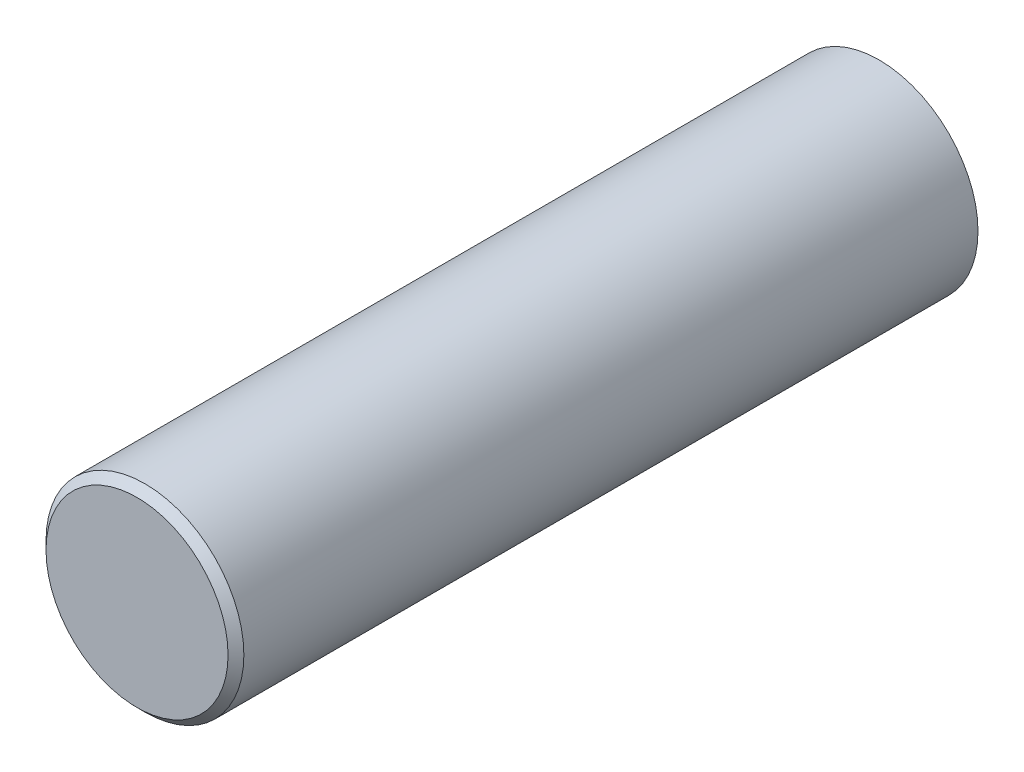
ISO-10303-21;
HEADER;
FILE_DESCRIPTION(('STEP AP214'),'2;1');
FILE_NAME('part.step','',(''),(''),'','','');
FILE_SCHEMA(('AUTOMOTIVE_DESIGN { 1 0 10303 214 1 1 1 1 }'));
ENDSEC;
DATA;
#1=APPLICATION_CONTEXT('core data for automotive mechanical design processes');
#2=APPLICATION_PROTOCOL_DEFINITION('international standard','automotive_design',2000,#1);
#3=PRODUCT_CONTEXT('',#1,'mechanical');
#4=PRODUCT('Part','Part','',(#3));
#5=PRODUCT_RELATED_PRODUCT_CATEGORY('part','',(#4));
#6=PRODUCT_DEFINITION_FORMATION('','',#4);
#7=PRODUCT_DEFINITION_CONTEXT('part definition',#1,'design');
#8=PRODUCT_DEFINITION('design','',#6,#7);
#9=PRODUCT_DEFINITION_SHAPE('','',#8);
#10=(LENGTH_UNIT() NAMED_UNIT(*) SI_UNIT(.MILLI.,.METRE.));
#11=(NAMED_UNIT(*) PLANE_ANGLE_UNIT() SI_UNIT($,.RADIAN.));
#12=(NAMED_UNIT(*) SI_UNIT($,.STERADIAN.) SOLID_ANGLE_UNIT());
#13=UNCERTAINTY_MEASURE_WITH_UNIT(LENGTH_MEASURE(1.E-05),#10,'distance_accuracy_value','');
#14=(GEOMETRIC_REPRESENTATION_CONTEXT(3) GLOBAL_UNCERTAINTY_ASSIGNED_CONTEXT((#13)) GLOBAL_UNIT_ASSIGNED_CONTEXT((#10,
#11,#12)) REPRESENTATION_CONTEXT('',''));
#15=CARTESIAN_POINT('',(0.,0.,0.));
#16=DIRECTION('',(0.,0.,1.));
#17=DIRECTION('',(1.,0.,0.));
#18=AXIS2_PLACEMENT_3D('',#15,#16,#17);
#19=CARTESIAN_POINT('',(0.,0.,75.));
#20=DIRECTION('',(0.,0.,-1.));
#21=DIRECTION('',(-1.,0.,0.));
#22=AXIS2_PLACEMENT_3D('',#19,#20,#21);
#23=CYLINDRICAL_SURFACE('',#22,10.);
#24=CARTESIAN_POINT('',(0.,0.,74.2));
#25=DIRECTION('',(0.,0.,1.));
#26=DIRECTION('',(1.,0.,0.));
#27=AXIS2_PLACEMENT_3D('',#24,#25,#26);
#28=CIRCLE('',#27,10.);
#29=CARTESIAN_POINT('',(10.,0.,74.2));
#30=VERTEX_POINT('',#29);
#31=EDGE_CURVE('E10',#30,#30,#28,.F.);
#32=ORIENTED_EDGE('',*,*,#31,.T.);
#33=EDGE_LOOP('',(#32));
#34=FACE_BOUND('',#33,.T.);
#35=CARTESIAN_POINT('',(0.,0.,0.));
#36=DIRECTION('',(0.,0.,1.));
#37=DIRECTION('',(1.,0.,0.));
#38=AXIS2_PLACEMENT_3D('',#35,#36,#37);
#39=CIRCLE('',#38,10.);
#40=CARTESIAN_POINT('',(10.,0.,0.));
#41=VERTEX_POINT('',#40);
#42=EDGE_CURVE('E37',#41,#41,#39,.T.);
#43=ORIENTED_EDGE('',*,*,#42,.T.);
#44=EDGE_LOOP('',(#43));
#45=FACE_BOUND('',#44,.T.);
#46=ADVANCED_FACE('F27',(#34,#45),#23,.T.);
#47=CARTESIAN_POINT('',(0.,0.,75.));
#48=DIRECTION('',(0.,0.,1.));
#49=DIRECTION('',(1.,0.,0.));
#50=AXIS2_PLACEMENT_3D('',#47,#48,#49);
#51=PLANE('',#50);
#52=CARTESIAN_POINT('',(0.,0.,75.));
#53=DIRECTION('',(0.,0.,1.));
#54=DIRECTION('',(1.,0.,0.));
#55=AXIS2_PLACEMENT_3D('',#52,#53,#54);
#56=CIRCLE('',#55,9.20000000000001);
#57=CARTESIAN_POINT('',(9.20000000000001,0.,75.));
#58=VERTEX_POINT('',#57);
#59=EDGE_CURVE('E33',#58,#58,#56,.T.);
#60=ORIENTED_EDGE('',*,*,#59,.T.);
#61=EDGE_LOOP('',(#60));
#62=FACE_BOUND('',#61,.T.);
#63=ADVANCED_FACE('F48',(#62),#51,.T.);
#64=CARTESIAN_POINT('',(0.,0.,0.));
#65=DIRECTION('',(0.,0.,1.));
#66=DIRECTION('',(1.,0.,0.));
#67=AXIS2_PLACEMENT_3D('',#64,#65,#66);
#68=PLANE('',#67);
#69=ORIENTED_EDGE('',*,*,#42,.F.);
#70=EDGE_LOOP('',(#69));
#71=FACE_BOUND('',#70,.T.);
#72=ADVANCED_FACE('F45',(#71),#68,.F.);
#73=CARTESIAN_POINT('',(0.,0.,75.));
#74=DIRECTION('',(0.,0.,-1.));
#75=DIRECTION('',(-1.,0.,0.));
#76=AXIS2_PLACEMENT_3D('',#73,#74,#75);
#77=CONICAL_SURFACE('',#76,9.20000000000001,0.785398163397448);
#78=ORIENTED_EDGE('',*,*,#31,.F.);
#79=EDGE_LOOP('',(#78));
#80=FACE_BOUND('',#79,.T.);
#81=ORIENTED_EDGE('',*,*,#59,.F.);
#82=EDGE_LOOP('',(#81));
#83=FACE_BOUND('',#82,.T.);
#84=ADVANCED_FACE('F47',(#80,#83),#77,.T.);
#85=CLOSED_SHELL('',(#46,#63,#72,#84));
#86=MANIFOLD_SOLID_BREP('B2',#85);
#87=ADVANCED_BREP_SHAPE_REPRESENTATION('',(#18,#86),#14);
#88=SHAPE_DEFINITION_REPRESENTATION(#9,#87);
ENDSEC;
END-ISO-10303-21;
